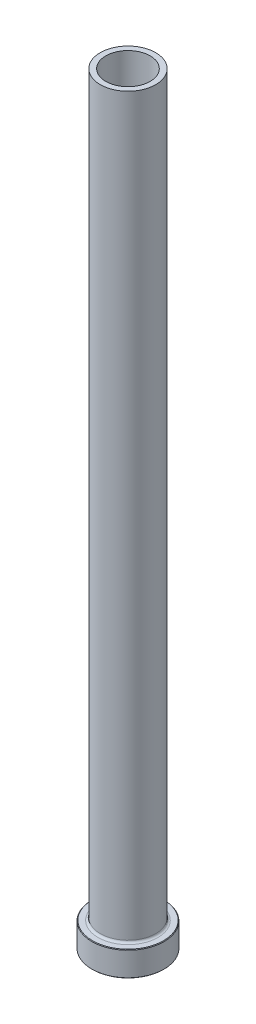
ISO-10303-21;
HEADER;
FILE_DESCRIPTION(('STEP AP214'),'2;1');
FILE_NAME('part.step','',(''),(''),'','','');
FILE_SCHEMA(('AUTOMOTIVE_DESIGN { 1 0 10303 214 1 1 1 1 }'));
ENDSEC;
DATA;
#1=APPLICATION_CONTEXT('core data for automotive mechanical design processes');
#2=APPLICATION_PROTOCOL_DEFINITION('international standard','automotive_design',2000,#1);
#3=PRODUCT_CONTEXT('',#1,'mechanical');
#4=PRODUCT('Part','Part','',(#3));
#5=PRODUCT_RELATED_PRODUCT_CATEGORY('part','',(#4));
#6=PRODUCT_DEFINITION_FORMATION('','',#4);
#7=PRODUCT_DEFINITION_CONTEXT('part definition',#1,'design');
#8=PRODUCT_DEFINITION('design','',#6,#7);
#9=PRODUCT_DEFINITION_SHAPE('','',#8);
#10=(LENGTH_UNIT() NAMED_UNIT(*) SI_UNIT(.MILLI.,.METRE.));
#11=(NAMED_UNIT(*) PLANE_ANGLE_UNIT() SI_UNIT($,.RADIAN.));
#12=(NAMED_UNIT(*) SI_UNIT($,.STERADIAN.) SOLID_ANGLE_UNIT());
#13=UNCERTAINTY_MEASURE_WITH_UNIT(LENGTH_MEASURE(1.E-05),#10,'distance_accuracy_value','');
#14=(GEOMETRIC_REPRESENTATION_CONTEXT(3) GLOBAL_UNCERTAINTY_ASSIGNED_CONTEXT((#13)) GLOBAL_UNIT_ASSIGNED_CONTEXT((#10,
#11,#12)) REPRESENTATION_CONTEXT('',''));
#15=CARTESIAN_POINT('',(0.,0.,0.));
#16=DIRECTION('',(0.,0.,1.));
#17=DIRECTION('',(1.,0.,0.));
#18=AXIS2_PLACEMENT_3D('',#15,#16,#17);
#19=CARTESIAN_POINT('',(0.,92.1876809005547,0.));
#20=DIRECTION('',(0.,1.,0.));
#21=DIRECTION('',(0.,0.,1.));
#22=AXIS2_PLACEMENT_3D('',#19,#20,#21);
#23=CYLINDRICAL_SURFACE('',#22,8.00000000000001);
#24=CARTESIAN_POINT('',(0.,275.,0.));
#25=DIRECTION('',(0.,1.,0.));
#26=DIRECTION('',(0.,0.,1.));
#27=AXIS2_PLACEMENT_3D('',#24,#25,#26);
#28=CIRCLE('',#27,8.00000000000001);
#29=CARTESIAN_POINT('',(0.,275.,8.00000000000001));
#30=VERTEX_POINT('',#29);
#31=EDGE_CURVE('E62',#30,#30,#28,.T.);
#32=ORIENTED_EDGE('',*,*,#31,.T.);
#33=EDGE_LOOP('',(#32));
#34=FACE_BOUND('',#33,.T.);
#35=CARTESIAN_POINT('',(0.,220.,0.));
#36=DIRECTION('',(0.,1.,0.));
#37=DIRECTION('',(0.,0.,1.));
#38=AXIS2_PLACEMENT_3D('',#35,#36,#37);
#39=CIRCLE('',#38,8.00000000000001);
#40=CARTESIAN_POINT('',(0.,220.,8.00000000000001));
#41=VERTEX_POINT('',#40);
#42=EDGE_CURVE('E71',#41,#41,#39,.T.);
#43=ORIENTED_EDGE('',*,*,#42,.F.);
#44=EDGE_LOOP('',(#43));
#45=FACE_BOUND('',#44,.T.);
#46=ADVANCED_FACE('F30',(#34,#45),#23,.F.);
#47=CARTESIAN_POINT('',(-8.00000000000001,275.,0.));
#48=DIRECTION('',(0.,1.,0.));
#49=DIRECTION('',(0.,0.,1.));
#50=AXIS2_PLACEMENT_3D('',#47,#48,#49);
#51=PLANE('',#50);
#52=CARTESIAN_POINT('',(0.,275.,0.));
#53=DIRECTION('',(0.,1.,0.));
#54=DIRECTION('',(0.,0.,1.));
#55=AXIS2_PLACEMENT_3D('',#52,#53,#54);
#56=CIRCLE('',#55,10.);
#57=CARTESIAN_POINT('',(0.,275.,10.));
#58=VERTEX_POINT('',#57);
#59=EDGE_CURVE('E65',#58,#58,#56,.T.);
#60=ORIENTED_EDGE('',*,*,#59,.T.);
#61=EDGE_LOOP('',(#60));
#62=FACE_BOUND('',#61,.T.);
#63=ORIENTED_EDGE('',*,*,#31,.F.);
#64=EDGE_LOOP('',(#63));
#65=FACE_BOUND('',#64,.T.);
#66=ADVANCED_FACE('F79',(#62,#65),#51,.T.);
#67=CARTESIAN_POINT('',(0.,92.1876809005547,0.));
#68=DIRECTION('',(0.,1.,0.));
#69=DIRECTION('',(0.,0.,1.));
#70=AXIS2_PLACEMENT_3D('',#67,#68,#69);
#71=CYLINDRICAL_SURFACE('',#70,10.);
#72=CARTESIAN_POINT('',(0.,9.8,0.));
#73=DIRECTION('',(0.,1.,0.));
#74=DIRECTION('',(0.,0.,1.));
#75=AXIS2_PLACEMENT_3D('',#72,#73,#74);
#76=CIRCLE('',#75,10.);
#77=CARTESIAN_POINT('',(0.,9.8,10.));
#78=VERTEX_POINT('',#77);
#79=EDGE_CURVE('E59',#78,#78,#76,.T.);
#80=ORIENTED_EDGE('',*,*,#79,.T.);
#81=EDGE_LOOP('',(#80));
#82=FACE_BOUND('',#81,.T.);
#83=ORIENTED_EDGE('',*,*,#59,.F.);
#84=EDGE_LOOP('',(#83));
#85=FACE_BOUND('',#84,.T.);
#86=ADVANCED_FACE('F85',(#82,#85),#71,.T.);
#87=CARTESIAN_POINT('',(-9.99999999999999,9.,0.));
#88=DIRECTION('',(0.,1.,0.));
#89=DIRECTION('',(0.,0.,1.));
#90=AXIS2_PLACEMENT_3D('',#87,#88,#89);
#91=PLANE('',#90);
#92=CARTESIAN_POINT('',(0.,9.,0.));
#93=DIRECTION('',(0.,1.,0.));
#94=DIRECTION('',(0.,0.,1.));
#95=AXIS2_PLACEMENT_3D('',#92,#93,#94);
#96=CIRCLE('',#95,12.7999999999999);
#97=CARTESIAN_POINT('',(0.,9.,12.7999999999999));
#98=VERTEX_POINT('',#97);
#99=EDGE_CURVE('E53',#98,#98,#96,.T.);
#100=ORIENTED_EDGE('',*,*,#99,.T.);
#101=EDGE_LOOP('',(#100));
#102=FACE_BOUND('',#101,.T.);
#103=CARTESIAN_POINT('',(0.,9.,0.));
#104=DIRECTION('',(0.,1.,0.));
#105=DIRECTION('',(0.,0.,1.));
#106=AXIS2_PLACEMENT_3D('',#103,#104,#105);
#107=CIRCLE('',#106,10.8);
#108=CARTESIAN_POINT('',(0.,9.,10.8));
#109=VERTEX_POINT('',#108);
#110=EDGE_CURVE('E56',#109,#109,#107,.F.);
#111=ORIENTED_EDGE('',*,*,#110,.T.);
#112=EDGE_LOOP('',(#111));
#113=FACE_BOUND('',#112,.T.);
#114=ADVANCED_FACE('F111',(#102,#113),#91,.T.);
#115=CARTESIAN_POINT('',(0.,92.1876809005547,0.));
#116=DIRECTION('',(0.,1.,0.));
#117=DIRECTION('',(0.,0.,1.));
#118=AXIS2_PLACEMENT_3D('',#115,#116,#117);
#119=CYLINDRICAL_SURFACE('',#118,13.);
#120=CARTESIAN_POINT('',(0.,8.79999999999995,0.));
#121=DIRECTION('',(0.,1.,0.));
#122=DIRECTION('',(0.,0.,1.));
#123=AXIS2_PLACEMENT_3D('',#120,#121,#122);
#124=CIRCLE('',#123,13.);
#125=CARTESIAN_POINT('',(0.,8.79999999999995,13.));
#126=VERTEX_POINT('',#125);
#127=EDGE_CURVE('E45',#126,#126,#124,.F.);
#128=ORIENTED_EDGE('',*,*,#127,.T.);
#129=EDGE_LOOP('',(#128));
#130=FACE_BOUND('',#129,.T.);
#131=CARTESIAN_POINT('',(0.,0.20000000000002,0.));
#132=DIRECTION('',(0.,-1.,0.));
#133=DIRECTION('',(0.,0.,-1.));
#134=AXIS2_PLACEMENT_3D('',#131,#132,#133);
#135=CIRCLE('',#134,13.);
#136=CARTESIAN_POINT('',(0.,0.20000000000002,-13.));
#137=VERTEX_POINT('',#136);
#138=EDGE_CURVE('E50',#137,#137,#135,.F.);
#139=ORIENTED_EDGE('',*,*,#138,.T.);
#140=EDGE_LOOP('',(#139));
#141=FACE_BOUND('',#140,.T.);
#142=ADVANCED_FACE('F108',(#130,#141),#119,.T.);
#143=CARTESIAN_POINT('',(-13.,0.,0.));
#144=DIRECTION('',(0.,-1.,0.));
#145=DIRECTION('',(0.,0.,-1.));
#146=AXIS2_PLACEMENT_3D('',#143,#144,#145);
#147=PLANE('',#146);
#148=CARTESIAN_POINT('',(0.,0.,0.));
#149=DIRECTION('',(0.,-1.,0.));
#150=DIRECTION('',(0.,0.,-1.));
#151=AXIS2_PLACEMENT_3D('',#148,#149,#150);
#152=CIRCLE('',#151,8.74999999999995);
#153=CARTESIAN_POINT('',(0.,0.,-8.74999999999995));
#154=VERTEX_POINT('',#153);
#155=EDGE_CURVE('E37',#154,#154,#152,.F.);
#156=ORIENTED_EDGE('',*,*,#155,.T.);
#157=EDGE_LOOP('',(#156));
#158=FACE_BOUND('',#157,.T.);
#159=CARTESIAN_POINT('',(0.,0.,0.));
#160=DIRECTION('',(0.,-1.,0.));
#161=DIRECTION('',(0.,0.,-1.));
#162=AXIS2_PLACEMENT_3D('',#159,#160,#161);
#163=CIRCLE('',#162,12.8);
#164=CARTESIAN_POINT('',(0.,0.,-12.8));
#165=VERTEX_POINT('',#164);
#166=EDGE_CURVE('E41',#165,#165,#163,.T.);
#167=ORIENTED_EDGE('',*,*,#166,.T.);
#168=EDGE_LOOP('',(#167));
#169=FACE_BOUND('',#168,.T.);
#170=ADVANCED_FACE('F110',(#158,#169),#147,.T.);
#171=CARTESIAN_POINT('',(0.,92.1876809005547,0.));
#172=DIRECTION('',(0.,1.,0.));
#173=DIRECTION('',(0.,0.,1.));
#174=AXIS2_PLACEMENT_3D('',#171,#172,#173);
#175=CYLINDRICAL_SURFACE('',#174,8.25);
#176=CARTESIAN_POINT('',(0.,0.499999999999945,0.));
#177=DIRECTION('',(0.,-1.,0.));
#178=DIRECTION('',(0.,0.,-1.));
#179=AXIS2_PLACEMENT_3D('',#176,#177,#178);
#180=CIRCLE('',#179,8.25);
#181=CARTESIAN_POINT('',(0.,0.499999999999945,-8.25));
#182=VERTEX_POINT('',#181);
#183=EDGE_CURVE('E10',#182,#182,#180,.T.);
#184=ORIENTED_EDGE('',*,*,#183,.T.);
#185=EDGE_LOOP('',(#184));
#186=FACE_BOUND('',#185,.T.);
#187=CARTESIAN_POINT('',(0.,208.,0.));
#188=DIRECTION('',(0.,1.,0.));
#189=DIRECTION('',(0.,0.,1.));
#190=AXIS2_PLACEMENT_3D('',#187,#188,#189);
#191=CIRCLE('',#190,8.25000000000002);
#192=CARTESIAN_POINT('',(0.,208.,8.25000000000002));
#193=VERTEX_POINT('',#192);
#194=EDGE_CURVE('E68',#193,#193,#191,.T.);
#195=ORIENTED_EDGE('',*,*,#194,.T.);
#196=EDGE_LOOP('',(#195));
#197=FACE_BOUND('',#196,.T.);
#198=ADVANCED_FACE('F118',(#186,#197),#175,.F.);
#199=CARTESIAN_POINT('',(0.,208.,0.));
#200=DIRECTION('',(0.,-1.,0.));
#201=DIRECTION('',(0.,0.,-1.));
#202=AXIS2_PLACEMENT_3D('',#199,#200,#201);
#203=CONICAL_SURFACE('',#202,8.25000000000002,0.0208303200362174);
#204=ORIENTED_EDGE('',*,*,#42,.T.);
#205=EDGE_LOOP('',(#204));
#206=FACE_BOUND('',#205,.T.);
#207=ORIENTED_EDGE('',*,*,#194,.F.);
#208=EDGE_LOOP('',(#207));
#209=FACE_BOUND('',#208,.T.);
#210=ADVANCED_FACE('F75',(#206,#209),#203,.F.);
#211=CARTESIAN_POINT('',(0.,9.8,0.));
#212=DIRECTION('',(0.,1.,0.));
#213=DIRECTION('',(0.,0.,1.));
#214=AXIS2_PLACEMENT_3D('',#211,#212,#213);
#215=TOROIDAL_SURFACE('',#214,10.8,0.8);
#216=ORIENTED_EDGE('',*,*,#110,.F.);
#217=EDGE_LOOP('',(#216));
#218=FACE_BOUND('',#217,.T.);
#219=ORIENTED_EDGE('',*,*,#79,.F.);
#220=EDGE_LOOP('',(#219));
#221=FACE_BOUND('',#220,.T.);
#222=ADVANCED_FACE('F90',(#218,#221),#215,.F.);
#223=CARTESIAN_POINT('',(0.,8.99999999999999,0.));
#224=DIRECTION('',(0.,-1.,0.));
#225=DIRECTION('',(0.,0.,-1.));
#226=AXIS2_PLACEMENT_3D('',#223,#224,#225);
#227=CONICAL_SURFACE('',#226,12.7999999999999,0.785398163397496);
#228=ORIENTED_EDGE('',*,*,#127,.F.);
#229=EDGE_LOOP('',(#228));
#230=FACE_BOUND('',#229,.T.);
#231=ORIENTED_EDGE('',*,*,#99,.F.);
#232=EDGE_LOOP('',(#231));
#233=FACE_BOUND('',#232,.T.);
#234=ADVANCED_FACE('F93',(#230,#233),#227,.T.);
#235=CARTESIAN_POINT('',(0.,0.20000000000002,0.));
#236=DIRECTION('',(0.,1.,0.));
#237=DIRECTION('',(0.,0.,1.));
#238=AXIS2_PLACEMENT_3D('',#235,#236,#237);
#239=CONICAL_SURFACE('',#238,13.,0.785398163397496);
#240=ORIENTED_EDGE('',*,*,#166,.F.);
#241=EDGE_LOOP('',(#240));
#242=FACE_BOUND('',#241,.T.);
#243=ORIENTED_EDGE('',*,*,#138,.F.);
#244=EDGE_LOOP('',(#243));
#245=FACE_BOUND('',#244,.T.);
#246=ADVANCED_FACE('F96',(#242,#245),#239,.T.);
#247=CARTESIAN_POINT('',(0.,0.,0.));
#248=DIRECTION('',(0.,-1.,0.));
#249=DIRECTION('',(0.,0.,-1.));
#250=AXIS2_PLACEMENT_3D('',#247,#248,#249);
#251=CONICAL_SURFACE('',#250,8.74999999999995,0.785398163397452);
#252=ORIENTED_EDGE('',*,*,#183,.F.);
#253=EDGE_LOOP('',(#252));
#254=FACE_BOUND('',#253,.T.);
#255=ORIENTED_EDGE('',*,*,#155,.F.);
#256=EDGE_LOOP('',(#255));
#257=FACE_BOUND('',#256,.T.);
#258=ADVANCED_FACE('F32',(#254,#257),#251,.F.);
#259=CLOSED_SHELL('',(#46,#66,#86,#114,#142,#170,#198,#210,#222,#234,#246,#258));
#260=MANIFOLD_SOLID_BREP('B2',#259);
#261=ADVANCED_BREP_SHAPE_REPRESENTATION('',(#18,#260),#14);
#262=SHAPE_DEFINITION_REPRESENTATION(#9,#261);
ENDSEC;
END-ISO-10303-21;
